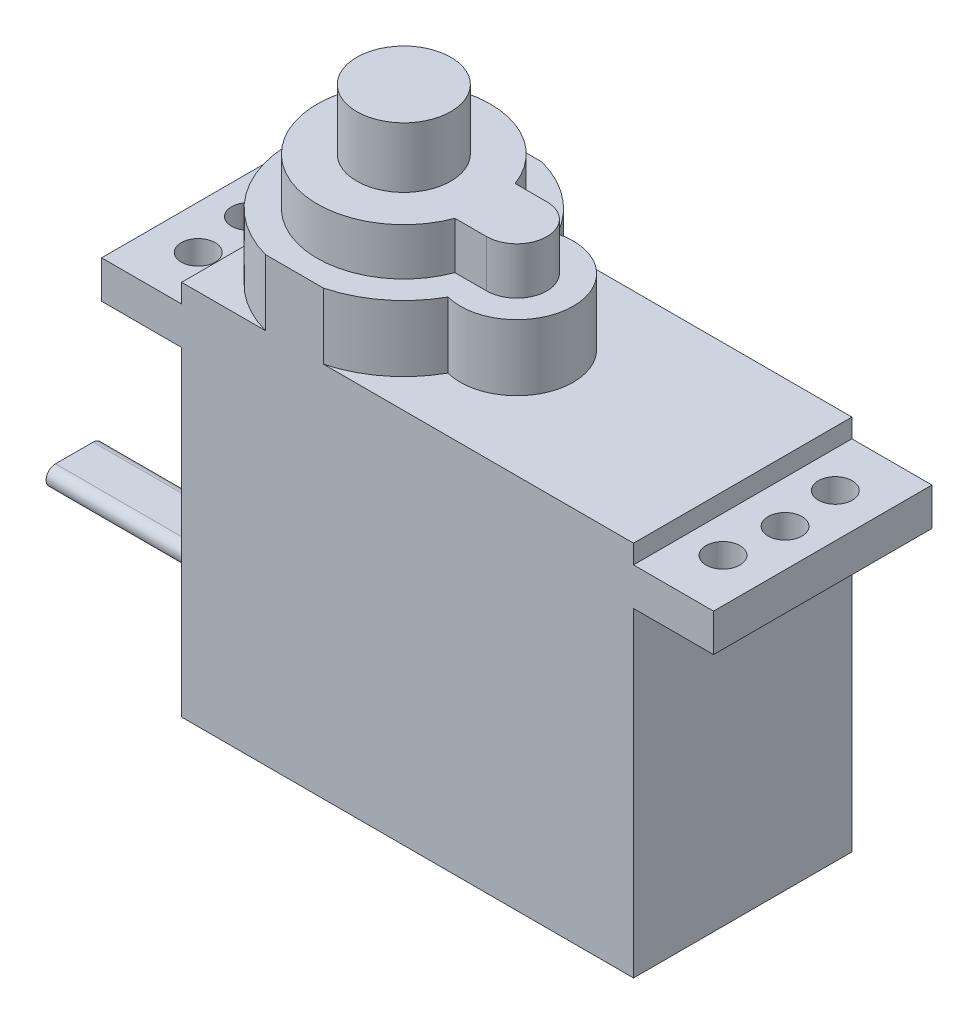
from build123d import *

# Parameters (mm, degrees)
EXTRUSION1_DEPTH        = 11.6
ESQUISSE2_R             = 0.9
ENL_V_MAT_EXTRU_1_DEPTH = 36.966964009
EXTRUSION2_DEPTH        = 3.5
EXTRUSION3_DEPTH        = 2.5
ESQUISSE5_R             = 2.5
EXTRUSION4_DEPTH        = 3.2
ESQUISSE6_W             = 6
ESQUISSE6_H             = 4
EXTRUSION5_DEPTH        = 1.5
EXTRUSION6_DEPTH        = 10


with BuildPart() as part:
    # Esquisse1 → Extrusion1 (new body)
    with BuildSketch(Plane.XY):
        Polygon((28.25, 19), (24, 19), (24, 20), (0, 20), (0, 19), (-4.25, 19), (-4.25, 17), (0, 17), (0, 0), (24, 0), (24, 17), (28.25, 17), align=None)
    extrude(amount=EXTRUSION1_DEPTH)

    # Esquisse2 → Enl_v. mat.-Extru.1 (cut, through all)
    with BuildSketch(Plane(origin=(0, 19, 0), x_dir=(1, 0, 0), z_dir=(0, 1, 0))):
        with Locations(Location((26.25, -5.8, 0), (0, 0, 270))):
            Circle(ESQUISSE2_R)
        with Locations(Location((-2.25, -5.8, 0), (0, 0, 270))):
            Circle(ESQUISSE2_R)
        with Locations(Location((-1.934210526, -2.816666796, 0), (0, 0, 270))):
            Circle(ESQUISSE2_R)
        with Locations(Location((-1.934210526, -8.783333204, 0), (0, 0, 270))):
            Circle(ESQUISSE2_R)
        with Locations(Location((25.934210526, -8.783333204, 0), (0, 0, 270))):
            Circle(ESQUISSE2_R)
        with Locations(Location((25.934210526, -2.816666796, 0), (0, 0, 270))):
            Circle(ESQUISSE2_R)
    extrude(amount=-ENL_V_MAT_EXTRU_1_DEPTH, mode=Mode.SUBTRACT)

    # Esquisse3 → Extrusion2 (add)
    with BuildSketch(Plane(origin=(0, 20, 0), x_dir=(1, 0, 0), z_dir=(0, 1, 0))):
        with BuildLine():
            Line((7.53622915, -11.6), (4.46377085, -11.6))
            ThreePointArc((4.46377085, -11.6), (0, -5.8), (4.46377085, 0))
            Line((4.46377085, 0), (7.53622915, 0))
            ThreePointArc((7.53622915, 0), (9.689019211, -1.068072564), (11.25, -2.89526249))
            ThreePointArc((11.25, -2.89526249), (15, -5.8), (11.25, -8.70473751))
            ThreePointArc((11.25, -8.70473751), (9.689019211, -10.531927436), (7.53622915, -11.6))
        make_face()
    extrude(amount=EXTRUSION2_DEPTH)

    # Esquisse4 → Extrusion3 (add)
    with BuildSketch(Plane(origin=(0, 23.5, 0), x_dir=(1, 0, 0), z_dir=(0, 1, 0))):
        with BuildLine():
            Line((12, -4.2), (10.312771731, -4.2))
            ThreePointArc((10.312771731, -4.2), (1.4, -5.8), (10.312771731, -7.4))
            Line((10.312771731, -7.4), (12, -7.4))
            ThreePointArc((12, -7.4), (13.6, -5.8), (12, -4.2))
        make_face()
    extrude(amount=EXTRUSION3_DEPTH)

    # Esquisse5 → Extrusion4 (add)
    with BuildSketch(Plane(origin=(0, 26, 0), x_dir=(1, 0, 0), z_dir=(0, 1, 0))):
        with Locations(Location((6, -5.8, 0), (0, 0, 270))):
            Circle(ESQUISSE5_R)
    extrude(amount=EXTRUSION4_DEPTH)

    # Esquisse6 → Extrusion5 (add)
    with BuildSketch(Plane.ZY):
        with Locations((5.8, 3)):
            Rectangle(ESQUISSE6_W, ESQUISSE6_H)
    extrude(amount=EXTRUSION5_DEPTH)

    # Esquisse7 → Extrusion6 (add)
    with BuildSketch(Plane.ZY.offset(1.5)):
        with BuildLine():
            Line((4.8, 2.5), (6.8, 2.5))
            ThreePointArc((6.8, 2.5), (7.3, 3), (6.8, 3.5))
            Line((6.8, 3.5), (4.8, 3.5))
            ThreePointArc((4.8, 3.5), (4.3, 3), (4.8, 2.5))
        make_face()
    extrude(amount=EXTRUSION6_DEPTH)


solid = part.part
